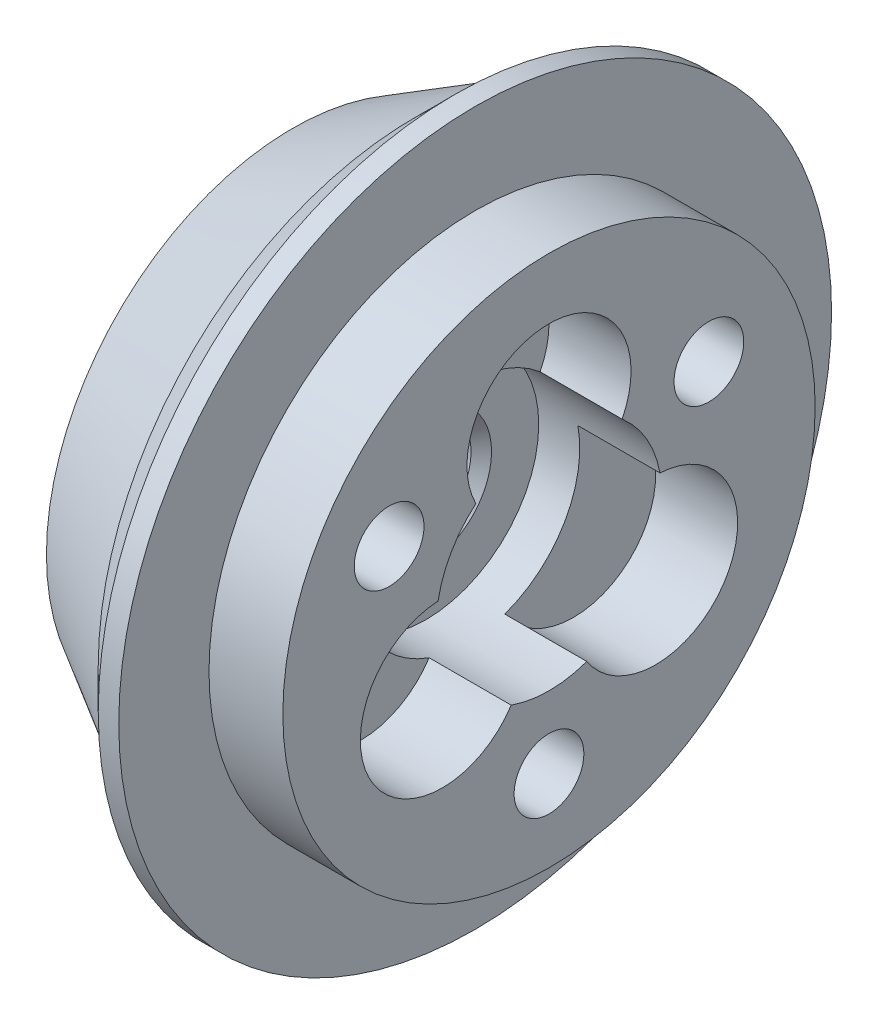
ISO-10303-21;
HEADER;
FILE_DESCRIPTION(('STEP AP214'),'2;1');
FILE_NAME('part.step','',(''),(''),'','','');
FILE_SCHEMA(('AUTOMOTIVE_DESIGN { 1 0 10303 214 1 1 1 1 }'));
ENDSEC;
DATA;
#1=APPLICATION_CONTEXT('core data for automotive mechanical design processes');
#2=APPLICATION_PROTOCOL_DEFINITION('international standard','automotive_design',2000,#1);
#3=PRODUCT_CONTEXT('',#1,'mechanical');
#4=PRODUCT('Part','Part','',(#3));
#5=PRODUCT_RELATED_PRODUCT_CATEGORY('part','',(#4));
#6=PRODUCT_DEFINITION_FORMATION('','',#4);
#7=PRODUCT_DEFINITION_CONTEXT('part definition',#1,'design');
#8=PRODUCT_DEFINITION('design','',#6,#7);
#9=PRODUCT_DEFINITION_SHAPE('','',#8);
#10=(LENGTH_UNIT() NAMED_UNIT(*) SI_UNIT(.MILLI.,.METRE.));
#11=(NAMED_UNIT(*) PLANE_ANGLE_UNIT() SI_UNIT($,.RADIAN.));
#12=(NAMED_UNIT(*) SI_UNIT($,.STERADIAN.) SOLID_ANGLE_UNIT());
#13=UNCERTAINTY_MEASURE_WITH_UNIT(LENGTH_MEASURE(1.E-05),#10,'distance_accuracy_value','');
#14=(GEOMETRIC_REPRESENTATION_CONTEXT(3) GLOBAL_UNCERTAINTY_ASSIGNED_CONTEXT((#13)) GLOBAL_UNIT_ASSIGNED_CONTEXT((#10,
#11,#12)) REPRESENTATION_CONTEXT('',''));
#15=CARTESIAN_POINT('',(0.,0.,0.));
#16=DIRECTION('',(0.,0.,1.));
#17=DIRECTION('',(1.,0.,0.));
#18=AXIS2_PLACEMENT_3D('',#15,#16,#17);
#19=CARTESIAN_POINT('',(6.,2.01,0.));
#20=DIRECTION('',(1.,0.,0.));
#21=DIRECTION('',(0.,0.,-1.));
#22=AXIS2_PLACEMENT_3D('',#19,#20,#21);
#23=PLANE('',#22);
#24=CARTESIAN_POINT('',(6.,0.,0.));
#25=DIRECTION('',(1.,0.,0.));
#26=DIRECTION('',(0.,0.,-1.));
#27=AXIS2_PLACEMENT_3D('',#24,#25,#26);
#28=CIRCLE('',#27,2.20999999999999);
#29=CARTESIAN_POINT('',(6.,0.,-2.20999999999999));
#30=VERTEX_POINT('',#29);
#31=EDGE_CURVE('E307',#30,#30,#28,.F.);
#32=ORIENTED_EDGE('',*,*,#31,.T.);
#33=EDGE_LOOP('',(#32));
#34=FACE_BOUND('',#33,.T.);
#35=CARTESIAN_POINT('',(6.,0.,0.));
#36=DIRECTION('',(1.,0.,0.));
#37=DIRECTION('',(0.,0.,-1.));
#38=AXIS2_PLACEMENT_3D('',#35,#36,#37);
#39=CIRCLE('',#38,4.5);
#40=CARTESIAN_POINT('',(6.,3.28178047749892,3.07894736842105));
#41=VERTEX_POINT('',#40);
#42=CARTESIAN_POINT('',(6.,-3.28178047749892,3.07894736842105));
#43=VERTEX_POINT('',#42);
#44=EDGE_CURVE('E13',#41,#43,#39,.T.);
#45=ORIENTED_EDGE('',*,*,#44,.T.);
#46=CARTESIAN_POINT('',(6.,-6.92820323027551,6.5));
#47=DIRECTION('',(1.,0.,0.));
#48=DIRECTION('',(0.,0.,-1.));
#49=AXIS2_PLACEMENT_3D('',#46,#47,#48);
#50=CIRCLE('',#49,5.);
#51=CARTESIAN_POINT('',(6.,-5.07028920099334,1.85800091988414));
#52=VERTEX_POINT('',#51);
#53=EDGE_CURVE('E229',#43,#52,#50,.F.);
#54=ORIENTED_EDGE('',*,*,#53,.T.);
#55=CARTESIAN_POINT('',(6.,0.,0.));
#56=DIRECTION('',(-1.,0.,0.));
#57=DIRECTION('',(0.,0.,1.));
#58=AXIS2_PLACEMENT_3D('',#55,#56,#57);
#59=CIRCLE('',#58,5.4);
#60=CARTESIAN_POINT('',(6.,-5.07028920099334,-1.85800091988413));
#61=VERTEX_POINT('',#60);
#62=EDGE_CURVE('E286',#61,#52,#59,.T.);
#63=ORIENTED_EDGE('',*,*,#62,.F.);
#64=CARTESIAN_POINT('',(6.,-6.92820323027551,-6.5));
#65=DIRECTION('',(1.,0.,0.));
#66=DIRECTION('',(0.,0.,-1.));
#67=AXIS2_PLACEMENT_3D('',#64,#65,#66);
#68=CIRCLE('',#67,5.);
#69=CARTESIAN_POINT('',(6.,-3.28178047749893,-3.07894736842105));
#70=VERTEX_POINT('',#69);
#71=EDGE_CURVE('E253',#61,#70,#68,.F.);
#72=ORIENTED_EDGE('',*,*,#71,.T.);
#73=CARTESIAN_POINT('',(6.,0.,0.));
#74=DIRECTION('',(1.,0.,0.));
#75=DIRECTION('',(0.,0.,-1.));
#76=AXIS2_PLACEMENT_3D('',#73,#74,#75);
#77=CIRCLE('',#76,4.5);
#78=CARTESIAN_POINT('',(6.,3.28178047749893,-3.07894736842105));
#79=VERTEX_POINT('',#78);
#80=EDGE_CURVE('E358',#70,#79,#77,.T.);
#81=ORIENTED_EDGE('',*,*,#80,.T.);
#82=CARTESIAN_POINT('',(6.,6.92820323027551,-6.5));
#83=DIRECTION('',(1.,0.,0.));
#84=DIRECTION('',(0.,0.,-1.));
#85=AXIS2_PLACEMENT_3D('',#82,#83,#84);
#86=CIRCLE('',#85,5.);
#87=CARTESIAN_POINT('',(6.,5.07028920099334,-1.85800091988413));
#88=VERTEX_POINT('',#87);
#89=EDGE_CURVE('E262',#88,#79,#86,.T.);
#90=ORIENTED_EDGE('',*,*,#89,.F.);
#91=CARTESIAN_POINT('',(6.,5.07028920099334,1.85800091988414));
#92=VERTEX_POINT('',#91);
#93=EDGE_CURVE('E285',#92,#88,#59,.T.);
#94=ORIENTED_EDGE('',*,*,#93,.F.);
#95=CARTESIAN_POINT('',(6.,6.92820323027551,6.5));
#96=DIRECTION('',(1.,0.,0.));
#97=DIRECTION('',(0.,0.,-1.));
#98=AXIS2_PLACEMENT_3D('',#95,#96,#97);
#99=CIRCLE('',#98,5.);
#100=EDGE_CURVE('E222',#41,#92,#99,.T.);
#101=ORIENTED_EDGE('',*,*,#100,.F.);
#102=EDGE_LOOP('',(#45,#54,#63,#72,#81,#90,#94,#101));
#103=FACE_BOUND('',#102,.T.);
#104=ADVANCED_FACE('F44',(#34,#103),#23,.T.);
#105=CARTESIAN_POINT('',(0.,0.,0.));
#106=DIRECTION('',(-1.,0.,0.));
#107=DIRECTION('',(0.,0.,1.));
#108=AXIS2_PLACEMENT_3D('',#105,#106,#107);
#109=CYLINDRICAL_SURFACE('',#108,5.4);
#110=CARTESIAN_POINT('',(12.,0.,0.));
#111=DIRECTION('',(1.,0.,0.));
#112=DIRECTION('',(0.,0.,-1.));
#113=AXIS2_PLACEMENT_3D('',#110,#111,#112);
#114=CIRCLE('',#113,5.4);
#115=CARTESIAN_POINT('',(12.,0.,-5.4));
#116=VERTEX_POINT('',#115);
#117=EDGE_CURVE('E322',#116,#116,#114,.T.);
#118=ORIENTED_EDGE('',*,*,#117,.T.);
#119=EDGE_LOOP('',(#118));
#120=FACE_BOUND('',#119,.T.);
#121=ORIENTED_EDGE('',*,*,#62,.T.);
#122=DIRECTION('',(-1.,0.,0.));
#123=VECTOR('',#122,1.);
#124=CARTESIAN_POINT('',(8.,-5.07028920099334,1.85800091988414));
#125=LINE('',#124,#123);
#126=CARTESIAN_POINT('',(10.,-5.07028920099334,1.85800091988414));
#127=VERTEX_POINT('',#126);
#128=EDGE_CURVE('E52',#52,#127,#125,.F.);
#129=ORIENTED_EDGE('',*,*,#128,.T.);
#130=CARTESIAN_POINT('',(10.,0.,0.));
#131=DIRECTION('',(-1.,0.,0.));
#132=DIRECTION('',(0.,0.,1.));
#133=AXIS2_PLACEMENT_3D('',#130,#131,#132);
#134=CIRCLE('',#133,5.4);
#135=CARTESIAN_POINT('',(10.,5.07028920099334,1.85800091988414));
#136=VERTEX_POINT('',#135);
#137=EDGE_CURVE('E361',#127,#136,#134,.T.);
#138=ORIENTED_EDGE('',*,*,#137,.T.);
#139=DIRECTION('',(-1.,0.,0.));
#140=VECTOR('',#139,1.);
#141=CARTESIAN_POINT('',(8.,5.07028920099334,1.85800091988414));
#142=LINE('',#141,#140);
#143=EDGE_CURVE('E364',#92,#136,#142,.F.);
#144=ORIENTED_EDGE('',*,*,#143,.F.);
#145=ORIENTED_EDGE('',*,*,#93,.T.);
#146=DIRECTION('',(-1.,0.,0.));
#147=VECTOR('',#146,1.);
#148=CARTESIAN_POINT('',(5.,5.07028920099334,-1.85800091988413));
#149=LINE('',#148,#147);
#150=CARTESIAN_POINT('',(10.,5.07028920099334,-1.85800091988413));
#151=VERTEX_POINT('',#150);
#152=EDGE_CURVE('E355',#151,#88,#149,.T.);
#153=ORIENTED_EDGE('',*,*,#152,.F.);
#154=CARTESIAN_POINT('',(10.,0.,0.));
#155=DIRECTION('',(-1.,0.,0.));
#156=DIRECTION('',(0.,0.,1.));
#157=AXIS2_PLACEMENT_3D('',#154,#155,#156);
#158=CIRCLE('',#157,5.4);
#159=CARTESIAN_POINT('',(10.,-5.07028920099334,-1.85800091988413));
#160=VERTEX_POINT('',#159);
#161=EDGE_CURVE('E349',#151,#160,#158,.T.);
#162=ORIENTED_EDGE('',*,*,#161,.T.);
#163=DIRECTION('',(-1.,0.,0.));
#164=VECTOR('',#163,1.);
#165=CARTESIAN_POINT('',(8.,-5.07028920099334,-1.85800091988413));
#166=LINE('',#165,#164);
#167=EDGE_CURVE('E352',#160,#61,#166,.T.);
#168=ORIENTED_EDGE('',*,*,#167,.T.);
#169=EDGE_LOOP('',(#121,#129,#138,#144,#145,#153,#162,#168));
#170=FACE_BOUND('',#169,.T.);
#171=ADVANCED_FACE('F367',(#120,#170),#109,.F.);
#172=CARTESIAN_POINT('',(0.,0.,0.));
#173=DIRECTION('',(1.,0.,0.));
#174=DIRECTION('',(0.,0.,-1.));
#175=AXIS2_PLACEMENT_3D('',#172,#173,#174);
#176=PLANE('',#175);
#177=CARTESIAN_POINT('',(0.,6.92820323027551,6.5));
#178=DIRECTION('',(-1.,0.,0.));
#179=DIRECTION('',(0.,0.,1.));
#180=AXIS2_PLACEMENT_3D('',#177,#178,#179);
#181=CIRCLE('',#180,5.);
#182=CARTESIAN_POINT('',(0.,10.5746259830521,9.92105263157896));
#183=VERTEX_POINT('',#182);
#184=CARTESIAN_POINT('',(0.,3.28178047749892,3.07894736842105));
#185=VERTEX_POINT('',#184);
#186=EDGE_CURVE('E212',#183,#185,#181,.T.);
#187=ORIENTED_EDGE('',*,*,#186,.F.);
#188=CARTESIAN_POINT('',(0.,0.,0.));
#189=DIRECTION('',(-1.,0.,0.));
#190=DIRECTION('',(0.,0.,1.));
#191=AXIS2_PLACEMENT_3D('',#188,#189,#190);
#192=CIRCLE('',#191,14.5);
#193=CARTESIAN_POINT('',(0.,-10.5746259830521,9.92105263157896));
#194=VERTEX_POINT('',#193);
#195=EDGE_CURVE('E59',#194,#183,#192,.T.);
#196=ORIENTED_EDGE('',*,*,#195,.F.);
#197=CARTESIAN_POINT('',(0.,-6.92820323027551,6.5));
#198=DIRECTION('',(-1.,0.,0.));
#199=DIRECTION('',(0.,0.,1.));
#200=AXIS2_PLACEMENT_3D('',#197,#198,#199);
#201=CIRCLE('',#200,5.);
#202=CARTESIAN_POINT('',(0.,-3.28178047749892,3.07894736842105));
#203=VERTEX_POINT('',#202);
#204=EDGE_CURVE('E205',#194,#203,#201,.F.);
#205=ORIENTED_EDGE('',*,*,#204,.T.);
#206=CARTESIAN_POINT('',(0.,0.,0.));
#207=DIRECTION('',(-1.,0.,0.));
#208=DIRECTION('',(0.,0.,1.));
#209=AXIS2_PLACEMENT_3D('',#206,#207,#208);
#210=CIRCLE('',#209,4.5);
#211=EDGE_CURVE('E215',#203,#185,#210,.T.);
#212=ORIENTED_EDGE('',*,*,#211,.T.);
#213=EDGE_LOOP('',(#187,#196,#205,#212));
#214=FACE_BOUND('',#213,.T.);
#215=CARTESIAN_POINT('',(0.,0.,0.));
#216=DIRECTION('',(-1.,0.,0.));
#217=DIRECTION('',(0.,0.,1.));
#218=AXIS2_PLACEMENT_3D('',#215,#216,#217);
#219=CIRCLE('',#218,14.5);
#220=CARTESIAN_POINT('',(0.,10.5746259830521,-9.92105263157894));
#221=VERTEX_POINT('',#220);
#222=CARTESIAN_POINT('',(0.,-10.5746259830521,-9.92105263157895));
#223=VERTEX_POINT('',#222);
#224=EDGE_CURVE('E243',#221,#223,#219,.T.);
#225=ORIENTED_EDGE('',*,*,#224,.F.);
#226=CARTESIAN_POINT('',(0.,6.92820323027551,-6.5));
#227=DIRECTION('',(-1.,0.,0.));
#228=DIRECTION('',(0.,0.,1.));
#229=AXIS2_PLACEMENT_3D('',#226,#227,#228);
#230=CIRCLE('',#229,5.);
#231=CARTESIAN_POINT('',(0.,3.28178047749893,-3.07894736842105));
#232=VERTEX_POINT('',#231);
#233=EDGE_CURVE('E232',#232,#221,#230,.T.);
#234=ORIENTED_EDGE('',*,*,#233,.F.);
#235=CARTESIAN_POINT('',(0.,0.,0.));
#236=DIRECTION('',(-1.,0.,0.));
#237=DIRECTION('',(0.,0.,1.));
#238=AXIS2_PLACEMENT_3D('',#235,#236,#237);
#239=CIRCLE('',#238,4.5);
#240=CARTESIAN_POINT('',(0.,-3.28178047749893,-3.07894736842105));
#241=VERTEX_POINT('',#240);
#242=EDGE_CURVE('E236',#232,#241,#239,.T.);
#243=ORIENTED_EDGE('',*,*,#242,.T.);
#244=CARTESIAN_POINT('',(0.,-6.92820323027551,-6.5));
#245=DIRECTION('',(-1.,0.,0.));
#246=DIRECTION('',(0.,0.,1.));
#247=AXIS2_PLACEMENT_3D('',#244,#245,#246);
#248=CIRCLE('',#247,5.);
#249=EDGE_CURVE('E246',#241,#223,#248,.F.);
#250=ORIENTED_EDGE('',*,*,#249,.T.);
#251=EDGE_LOOP('',(#225,#234,#243,#250));
#252=FACE_BOUND('',#251,.T.);
#253=CARTESIAN_POINT('',(0.,0.,0.));
#254=DIRECTION('',(1.,0.,0.));
#255=DIRECTION('',(0.,0.,-1.));
#256=AXIS2_PLACEMENT_3D('',#253,#254,#255);
#257=CIRCLE('',#256,2.21000000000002);
#258=CARTESIAN_POINT('',(0.,0.,-2.21000000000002));
#259=VERTEX_POINT('',#258);
#260=EDGE_CURVE('E316',#259,#259,#257,.T.);
#261=ORIENTED_EDGE('',*,*,#260,.T.);
#262=EDGE_LOOP('',(#261));
#263=FACE_BOUND('',#262,.T.);
#264=CARTESIAN_POINT('',(0.,0.,0.));
#265=DIRECTION('',(-1.,0.,0.));
#266=DIRECTION('',(0.,0.,1.));
#267=AXIS2_PLACEMENT_3D('',#264,#265,#266);
#268=CIRCLE('',#267,24.);
#269=CARTESIAN_POINT('',(0.,0.,24.));
#270=VERTEX_POINT('',#269);
#271=EDGE_CURVE('E304',#270,#270,#268,.T.);
#272=ORIENTED_EDGE('',*,*,#271,.T.);
#273=EDGE_LOOP('',(#272));
#274=FACE_BOUND('',#273,.T.);
#275=ADVANCED_FACE('F385',(#214,#252,#263,#274),#176,.F.);
#276=CARTESIAN_POINT('',(25.,25.95,0.));
#277=DIRECTION('',(-1.,0.,0.));
#278=DIRECTION('',(0.,0.,1.));
#279=AXIS2_PLACEMENT_3D('',#276,#277,#278);
#280=PLANE('',#279);
#281=CARTESIAN_POINT('',(25.,9.00000000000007,15.5884572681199));
#282=DIRECTION('',(1.,0.,0.));
#283=DIRECTION('',(0.,0.,-1.));
#284=AXIS2_PLACEMENT_3D('',#281,#282,#283);
#285=CIRCLE('',#284,3.4);
#286=CARTESIAN_POINT('',(25.,9.00000000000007,12.1884572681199));
#287=VERTEX_POINT('',#286);
#288=EDGE_CURVE('E186',#287,#287,#285,.T.);
#289=ORIENTED_EDGE('',*,*,#288,.F.);
#290=EDGE_LOOP('',(#289));
#291=FACE_BOUND('',#290,.T.);
#292=CARTESIAN_POINT('',(25.,8.99999999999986,-15.58845726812));
#293=DIRECTION('',(1.,0.,0.));
#294=DIRECTION('',(0.,0.,-1.));
#295=AXIS2_PLACEMENT_3D('',#292,#293,#294);
#296=CIRCLE('',#295,3.4);
#297=CARTESIAN_POINT('',(25.,8.99999999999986,-18.98845726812));
#298=VERTEX_POINT('',#297);
#299=EDGE_CURVE('E194',#298,#298,#296,.T.);
#300=ORIENTED_EDGE('',*,*,#299,.F.);
#301=EDGE_LOOP('',(#300));
#302=FACE_BOUND('',#301,.T.);
#303=CARTESIAN_POINT('',(25.,-18.,0.));
#304=DIRECTION('',(1.,0.,0.));
#305=DIRECTION('',(0.,0.,-1.));
#306=AXIS2_PLACEMENT_3D('',#303,#304,#305);
#307=CIRCLE('',#306,3.4);
#308=CARTESIAN_POINT('',(25.,-18.,-3.4));
#309=VERTEX_POINT('',#308);
#310=EDGE_CURVE('E200',#309,#309,#307,.T.);
#311=ORIENTED_EDGE('',*,*,#310,.F.);
#312=EDGE_LOOP('',(#311));
#313=FACE_BOUND('',#312,.T.);
#314=CARTESIAN_POINT('',(25.,0.,0.));
#315=DIRECTION('',(-1.,0.,0.));
#316=DIRECTION('',(0.,0.,1.));
#317=AXIS2_PLACEMENT_3D('',#314,#315,#316);
#318=CIRCLE('',#317,25.95);
#319=CARTESIAN_POINT('',(25.,0.,25.95));
#320=VERTEX_POINT('',#319);
#321=EDGE_CURVE('E289',#320,#320,#318,.T.);
#322=ORIENTED_EDGE('',*,*,#321,.F.);
#323=EDGE_LOOP('',(#322));
#324=FACE_BOUND('',#323,.T.);
#325=CARTESIAN_POINT('',(25.,0.,0.));
#326=DIRECTION('',(-1.,0.,0.));
#327=DIRECTION('',(0.,0.,1.));
#328=AXIS2_PLACEMENT_3D('',#325,#326,#327);
#329=CIRCLE('',#328,11.);
#330=CARTESIAN_POINT('',(25.,-10.3636259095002,-3.68717480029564));
#331=VERTEX_POINT('',#330);
#332=CARTESIAN_POINT('',(25.,-10.3636259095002,3.68717480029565));
#333=VERTEX_POINT('',#332);
#334=EDGE_CURVE('E282',#331,#333,#329,.T.);
#335=ORIENTED_EDGE('',*,*,#334,.T.);
#336=CARTESIAN_POINT('',(25.,-6.00000000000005,10.3923048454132));
#337=DIRECTION('',(1.,0.,0.));
#338=DIRECTION('',(0.,0.,-1.));
#339=AXIS2_PLACEMENT_3D('',#336,#337,#338);
#340=CIRCLE('',#339,8.);
#341=CARTESIAN_POINT('',(25.,1.98862590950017,10.8187507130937));
#342=VERTEX_POINT('',#341);
#343=EDGE_CURVE('E264',#342,#333,#340,.T.);
#344=ORIENTED_EDGE('',*,*,#343,.F.);
#345=CARTESIAN_POINT('',(25.,8.375,7.13157591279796));
#346=VERTEX_POINT('',#345);
#347=EDGE_CURVE('E275',#342,#346,#329,.T.);
#348=ORIENTED_EDGE('',*,*,#347,.T.);
#349=CARTESIAN_POINT('',(25.,12.,0.));
#350=DIRECTION('',(1.,0.,0.));
#351=DIRECTION('',(0.,0.,-1.));
#352=AXIS2_PLACEMENT_3D('',#349,#350,#351);
#353=CIRCLE('',#352,8.);
#354=CARTESIAN_POINT('',(25.,8.375,-7.13157591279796));
#355=VERTEX_POINT('',#354);
#356=EDGE_CURVE('E271',#355,#346,#353,.T.);
#357=ORIENTED_EDGE('',*,*,#356,.F.);
#358=CARTESIAN_POINT('',(25.,1.98862590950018,-10.8187507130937));
#359=VERTEX_POINT('',#358);
#360=EDGE_CURVE('E278',#355,#359,#329,.T.);
#361=ORIENTED_EDGE('',*,*,#360,.T.);
#362=CARTESIAN_POINT('',(25.,-6.00000000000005,-10.3923048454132));
#363=DIRECTION('',(1.,0.,0.));
#364=DIRECTION('',(0.,0.,-1.));
#365=AXIS2_PLACEMENT_3D('',#362,#363,#364);
#366=CIRCLE('',#365,8.00000000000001);
#367=EDGE_CURVE('E267',#331,#359,#366,.T.);
#368=ORIENTED_EDGE('',*,*,#367,.F.);
#369=EDGE_LOOP('',(#335,#344,#348,#357,#361,#368));
#370=FACE_BOUND('',#369,.T.);
#371=ADVANCED_FACE('F439',(#291,#302,#313,#324,#370),#280,.F.);
#372=CARTESIAN_POINT('',(11.95,0.,0.));
#373=DIRECTION('',(1.,0.,0.));
#374=DIRECTION('',(0.,0.,-1.));
#375=AXIS2_PLACEMENT_3D('',#372,#373,#374);
#376=CONICAL_SURFACE('',#375,30.9,0.523640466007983);
#377=ORIENTED_EDGE('',*,*,#271,.F.);
#378=EDGE_LOOP('',(#377));
#379=FACE_BOUND('',#378,.T.);
#380=CARTESIAN_POINT('',(11.95,0.,0.));
#381=DIRECTION('',(-1.,0.,0.));
#382=DIRECTION('',(0.,0.,1.));
#383=AXIS2_PLACEMENT_3D('',#380,#381,#382);
#384=CIRCLE('',#383,30.9);
#385=CARTESIAN_POINT('',(11.95,0.,30.9));
#386=VERTEX_POINT('',#385);
#387=EDGE_CURVE('E301',#386,#386,#384,.T.);
#388=ORIENTED_EDGE('',*,*,#387,.T.);
#389=EDGE_LOOP('',(#388));
#390=FACE_BOUND('',#389,.T.);
#391=ADVANCED_FACE('F442',(#379,#390),#376,.T.);
#392=CARTESIAN_POINT('',(15.8,0.,0.));
#393=DIRECTION('',(1.,0.,0.));
#394=DIRECTION('',(0.,0.,-1.));
#395=AXIS2_PLACEMENT_3D('',#392,#393,#394);
#396=CONICAL_SURFACE('',#395,34.75,0.785398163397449);
#397=ORIENTED_EDGE('',*,*,#387,.F.);
#398=EDGE_LOOP('',(#397));
#399=FACE_BOUND('',#398,.T.);
#400=CARTESIAN_POINT('',(15.8,0.,0.));
#401=DIRECTION('',(-1.,0.,0.));
#402=DIRECTION('',(0.,0.,1.));
#403=AXIS2_PLACEMENT_3D('',#400,#401,#402);
#404=CIRCLE('',#403,34.75);
#405=CARTESIAN_POINT('',(15.8,0.,34.75));
#406=VERTEX_POINT('',#405);
#407=EDGE_CURVE('E298',#406,#406,#404,.T.);
#408=ORIENTED_EDGE('',*,*,#407,.T.);
#409=EDGE_LOOP('',(#408));
#410=FACE_BOUND('',#409,.T.);
#411=ADVANCED_FACE('F454',(#399,#410),#396,.T.);
#412=CARTESIAN_POINT('',(0.,0.,0.));
#413=DIRECTION('',(-1.,0.,0.));
#414=DIRECTION('',(0.,0.,1.));
#415=AXIS2_PLACEMENT_3D('',#412,#413,#414);
#416=CYLINDRICAL_SURFACE('',#415,34.75);
#417=ORIENTED_EDGE('',*,*,#407,.F.);
#418=EDGE_LOOP('',(#417));
#419=FACE_BOUND('',#418,.T.);
#420=CARTESIAN_POINT('',(17.8,0.,0.));
#421=DIRECTION('',(-1.,0.,0.));
#422=DIRECTION('',(0.,0.,1.));
#423=AXIS2_PLACEMENT_3D('',#420,#421,#422);
#424=CIRCLE('',#423,34.75);
#425=CARTESIAN_POINT('',(17.8,0.,34.75));
#426=VERTEX_POINT('',#425);
#427=EDGE_CURVE('E295',#426,#426,#424,.T.);
#428=ORIENTED_EDGE('',*,*,#427,.T.);
#429=EDGE_LOOP('',(#428));
#430=FACE_BOUND('',#429,.T.);
#431=ADVANCED_FACE('F450',(#419,#430),#416,.T.);
#432=CARTESIAN_POINT('',(17.8,34.75,0.));
#433=DIRECTION('',(-1.,0.,0.));
#434=DIRECTION('',(0.,0.,1.));
#435=AXIS2_PLACEMENT_3D('',#432,#433,#434);
#436=PLANE('',#435);
#437=ORIENTED_EDGE('',*,*,#427,.F.);
#438=EDGE_LOOP('',(#437));
#439=FACE_BOUND('',#438,.T.);
#440=CARTESIAN_POINT('',(17.8,0.,0.));
#441=DIRECTION('',(-1.,0.,0.));
#442=DIRECTION('',(0.,0.,1.));
#443=AXIS2_PLACEMENT_3D('',#440,#441,#442);
#444=CIRCLE('',#443,25.95);
#445=CARTESIAN_POINT('',(17.8,0.,25.95));
#446=VERTEX_POINT('',#445);
#447=EDGE_CURVE('E292',#446,#446,#444,.T.);
#448=ORIENTED_EDGE('',*,*,#447,.T.);
#449=EDGE_LOOP('',(#448));
#450=FACE_BOUND('',#449,.T.);
#451=ADVANCED_FACE('F446',(#439,#450),#436,.F.);
#452=CARTESIAN_POINT('',(0.,0.,0.));
#453=DIRECTION('',(-1.,0.,0.));
#454=DIRECTION('',(0.,0.,1.));
#455=AXIS2_PLACEMENT_3D('',#452,#453,#454);
#456=CYLINDRICAL_SURFACE('',#455,25.95);
#457=ORIENTED_EDGE('',*,*,#447,.F.);
#458=EDGE_LOOP('',(#457));
#459=FACE_BOUND('',#458,.T.);
#460=ORIENTED_EDGE('',*,*,#321,.T.);
#461=EDGE_LOOP('',(#460));
#462=FACE_BOUND('',#461,.T.);
#463=ADVANCED_FACE('F437',(#459,#462),#456,.T.);
#464=CARTESIAN_POINT('',(0.,0.,0.));
#465=DIRECTION('',(-1.,0.,0.));
#466=DIRECTION('',(0.,0.,1.));
#467=AXIS2_PLACEMENT_3D('',#464,#465,#466);
#468=CYLINDRICAL_SURFACE('',#467,2.01);
#469=CARTESIAN_POINT('',(5.80000000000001,0.,0.));
#470=DIRECTION('',(1.,0.,0.));
#471=DIRECTION('',(0.,0.,-1.));
#472=AXIS2_PLACEMENT_3D('',#469,#470,#471);
#473=CIRCLE('',#472,2.01);
#474=CARTESIAN_POINT('',(5.80000000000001,0.,-2.01));
#475=VERTEX_POINT('',#474);
#476=EDGE_CURVE('E313',#475,#475,#473,.T.);
#477=ORIENTED_EDGE('',*,*,#476,.T.);
#478=EDGE_LOOP('',(#477));
#479=FACE_BOUND('',#478,.T.);
#480=CARTESIAN_POINT('',(0.200000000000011,0.,0.));
#481=DIRECTION('',(1.,0.,0.));
#482=DIRECTION('',(0.,0.,-1.));
#483=AXIS2_PLACEMENT_3D('',#480,#481,#482);
#484=CIRCLE('',#483,2.01);
#485=CARTESIAN_POINT('',(0.200000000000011,0.,-2.01));
#486=VERTEX_POINT('',#485);
#487=EDGE_CURVE('E310',#486,#486,#484,.F.);
#488=ORIENTED_EDGE('',*,*,#487,.T.);
#489=EDGE_LOOP('',(#488));
#490=FACE_BOUND('',#489,.T.);
#491=ADVANCED_FACE('F433',(#479,#490),#468,.F.);
#492=CARTESIAN_POINT('',(13.,5.4,0.));
#493=DIRECTION('',(1.,0.,0.));
#494=DIRECTION('',(0.,0.,-1.));
#495=AXIS2_PLACEMENT_3D('',#492,#493,#494);
#496=PLANE('',#495);
#497=CARTESIAN_POINT('',(13.,0.,0.));
#498=DIRECTION('',(1.,0.,0.));
#499=DIRECTION('',(0.,0.,-1.));
#500=AXIS2_PLACEMENT_3D('',#497,#498,#499);
#501=CIRCLE('',#500,6.39999999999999);
#502=CARTESIAN_POINT('',(13.,0.,-6.39999999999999));
#503=VERTEX_POINT('',#502);
#504=EDGE_CURVE('E319',#503,#503,#501,.F.);
#505=ORIENTED_EDGE('',*,*,#504,.T.);
#506=EDGE_LOOP('',(#505));
#507=FACE_BOUND('',#506,.T.);
#508=CARTESIAN_POINT('',(13.,0.,0.));
#509=DIRECTION('',(-1.,0.,0.));
#510=DIRECTION('',(0.,0.,1.));
#511=AXIS2_PLACEMENT_3D('',#508,#509,#510);
#512=CIRCLE('',#511,11.);
#513=CARTESIAN_POINT('',(13.,0.,11.));
#514=VERTEX_POINT('',#513);
#515=EDGE_CURVE('E281',#514,#514,#512,.T.);
#516=ORIENTED_EDGE('',*,*,#515,.F.);
#517=EDGE_LOOP('',(#516));
#518=FACE_BOUND('',#517,.T.);
#519=ADVANCED_FACE('F436',(#507,#518),#496,.T.);
#520=CARTESIAN_POINT('',(0.,0.,0.));
#521=DIRECTION('',(-1.,0.,0.));
#522=DIRECTION('',(0.,0.,1.));
#523=AXIS2_PLACEMENT_3D('',#520,#521,#522);
#524=CYLINDRICAL_SURFACE('',#523,11.);
#525=DIRECTION('',(1.,0.,0.));
#526=VECTOR('',#525,1.);
#527=CARTESIAN_POINT('',(21.,1.98862590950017,10.8187507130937));
#528=LINE('',#527,#526);
#529=CARTESIAN_POINT('',(17.,1.98862590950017,10.8187507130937));
#530=VERTEX_POINT('',#529);
#531=EDGE_CURVE('E347',#530,#342,#528,.T.);
#532=ORIENTED_EDGE('',*,*,#531,.F.);
#533=CARTESIAN_POINT('',(17.,0.,0.));
#534=DIRECTION('',(1.,0.,0.));
#535=DIRECTION('',(0.,0.,-1.));
#536=AXIS2_PLACEMENT_3D('',#533,#534,#535);
#537=CIRCLE('',#536,11.);
#538=CARTESIAN_POINT('',(17.,-10.3636259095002,3.68717480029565));
#539=VERTEX_POINT('',#538);
#540=EDGE_CURVE('E341',#530,#539,#537,.T.);
#541=ORIENTED_EDGE('',*,*,#540,.T.);
#542=DIRECTION('',(1.,0.,0.));
#543=VECTOR('',#542,1.);
#544=CARTESIAN_POINT('',(21.,-10.3636259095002,3.68717480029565));
#545=LINE('',#544,#543);
#546=EDGE_CURVE('E344',#333,#539,#545,.F.);
#547=ORIENTED_EDGE('',*,*,#546,.F.);
#548=ORIENTED_EDGE('',*,*,#334,.F.);
#549=DIRECTION('',(1.,0.,0.));
#550=VECTOR('',#549,1.);
#551=CARTESIAN_POINT('',(21.,-10.3636259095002,-3.68717480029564));
#552=LINE('',#551,#550);
#553=CARTESIAN_POINT('',(17.,-10.3636259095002,-3.68717480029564));
#554=VERTEX_POINT('',#553);
#555=EDGE_CURVE('E339',#554,#331,#552,.T.);
#556=ORIENTED_EDGE('',*,*,#555,.F.);
#557=CARTESIAN_POINT('',(17.,0.,0.));
#558=DIRECTION('',(1.,0.,0.));
#559=DIRECTION('',(0.,0.,-1.));
#560=AXIS2_PLACEMENT_3D('',#557,#558,#559);
#561=CIRCLE('',#560,11.);
#562=CARTESIAN_POINT('',(17.,1.98862590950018,-10.8187507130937));
#563=VERTEX_POINT('',#562);
#564=EDGE_CURVE('E333',#554,#563,#561,.T.);
#565=ORIENTED_EDGE('',*,*,#564,.T.);
#566=DIRECTION('',(1.,0.,0.));
#567=VECTOR('',#566,1.);
#568=CARTESIAN_POINT('',(21.,1.98862590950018,-10.8187507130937));
#569=LINE('',#568,#567);
#570=EDGE_CURVE('E336',#359,#563,#569,.F.);
#571=ORIENTED_EDGE('',*,*,#570,.F.);
#572=ORIENTED_EDGE('',*,*,#360,.F.);
#573=DIRECTION('',(1.,0.,0.));
#574=VECTOR('',#573,1.);
#575=CARTESIAN_POINT('',(21.,8.375,-7.13157591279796));
#576=LINE('',#575,#574);
#577=CARTESIAN_POINT('',(17.,8.375,-7.13157591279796));
#578=VERTEX_POINT('',#577);
#579=EDGE_CURVE('E331',#578,#355,#576,.T.);
#580=ORIENTED_EDGE('',*,*,#579,.F.);
#581=CARTESIAN_POINT('',(17.,0.,0.));
#582=DIRECTION('',(1.,0.,0.));
#583=DIRECTION('',(0.,0.,-1.));
#584=AXIS2_PLACEMENT_3D('',#581,#582,#583);
#585=CIRCLE('',#584,11.);
#586=CARTESIAN_POINT('',(17.,8.375,7.13157591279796));
#587=VERTEX_POINT('',#586);
#588=EDGE_CURVE('E325',#578,#587,#585,.T.);
#589=ORIENTED_EDGE('',*,*,#588,.T.);
#590=DIRECTION('',(1.,0.,0.));
#591=VECTOR('',#590,1.);
#592=CARTESIAN_POINT('',(21.,8.375,7.13157591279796));
#593=LINE('',#592,#591);
#594=EDGE_CURVE('E328',#346,#587,#593,.F.);
#595=ORIENTED_EDGE('',*,*,#594,.F.);
#596=ORIENTED_EDGE('',*,*,#347,.F.);
#597=EDGE_LOOP('',(#532,#541,#547,#548,#556,#565,#571,#572,#580,#589,#595,#596));
#598=FACE_BOUND('',#597,.T.);
#599=ORIENTED_EDGE('',*,*,#515,.T.);
#600=EDGE_LOOP('',(#599));
#601=FACE_BOUND('',#600,.T.);
#602=ADVANCED_FACE('F467',(#598,#601),#524,.F.);
#603=CARTESIAN_POINT('',(6.,0.,0.));
#604=DIRECTION('',(1.,0.,0.));
#605=DIRECTION('',(0.,0.,-1.));
#606=AXIS2_PLACEMENT_3D('',#603,#604,#605);
#607=CONICAL_SURFACE('',#606,2.20999999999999,0.78539816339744);
#608=CARTESIAN_POINT('',(5.80000000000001,0.,-2.01));
#609=CARTESIAN_POINT('',(5.80208333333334,0.,-2.01208333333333));
#610=CARTESIAN_POINT('',(5.80416666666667,0.,-2.01416666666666));
#611=CARTESIAN_POINT('',(5.80833333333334,0.,-2.01833333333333));
#612=CARTESIAN_POINT('',(5.81041666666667,0.,-2.02041666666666));
#613=CARTESIAN_POINT('',(5.81458333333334,0.,-2.02458333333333));
#614=CARTESIAN_POINT('',(5.81666666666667,0.,-2.02666666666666));
#615=CARTESIAN_POINT('',(5.82083333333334,0.,-2.03083333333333));
#616=CARTESIAN_POINT('',(5.82291666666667,0.,-2.03291666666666));
#617=CARTESIAN_POINT('',(5.82708333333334,0.,-2.03708333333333));
#618=CARTESIAN_POINT('',(5.82916666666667,0.,-2.03916666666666));
#619=CARTESIAN_POINT('',(5.83333333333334,0.,-2.04333333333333));
#620=CARTESIAN_POINT('',(5.83541666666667,0.,-2.04541666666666));
#621=CARTESIAN_POINT('',(5.83958333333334,0.,-2.04958333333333));
#622=CARTESIAN_POINT('',(5.84166666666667,0.,-2.05166666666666));
#623=CARTESIAN_POINT('',(5.84583333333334,0.,-2.05583333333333));
#624=CARTESIAN_POINT('',(5.84791666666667,0.,-2.05791666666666));
#625=CARTESIAN_POINT('',(5.85208333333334,0.,-2.06208333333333));
#626=CARTESIAN_POINT('',(5.85416666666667,0.,-2.06416666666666));
#627=CARTESIAN_POINT('',(5.85833333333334,0.,-2.06833333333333));
#628=CARTESIAN_POINT('',(5.86041666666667,0.,-2.07041666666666));
#629=CARTESIAN_POINT('',(5.86458333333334,0.,-2.07458333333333));
#630=CARTESIAN_POINT('',(5.86666666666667,0.,-2.07666666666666));
#631=CARTESIAN_POINT('',(5.87083333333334,0.,-2.08083333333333));
#632=CARTESIAN_POINT('',(5.87291666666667,0.,-2.08291666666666));
#633=CARTESIAN_POINT('',(5.87708333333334,0.,-2.08708333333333));
#634=CARTESIAN_POINT('',(5.87916666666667,0.,-2.08916666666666));
#635=CARTESIAN_POINT('',(5.88333333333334,0.,-2.09333333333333));
#636=CARTESIAN_POINT('',(5.88541666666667,0.,-2.09541666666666));
#637=CARTESIAN_POINT('',(5.88958333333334,0.,-2.09958333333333));
#638=CARTESIAN_POINT('',(5.89166666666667,0.,-2.10166666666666));
#639=CARTESIAN_POINT('',(5.89583333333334,0.,-2.10583333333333));
#640=CARTESIAN_POINT('',(5.89791666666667,0.,-2.10791666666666));
#641=CARTESIAN_POINT('',(5.90208333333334,0.,-2.11208333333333));
#642=CARTESIAN_POINT('',(5.90416666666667,0.,-2.11416666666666));
#643=CARTESIAN_POINT('',(5.90833333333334,0.,-2.11833333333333));
#644=CARTESIAN_POINT('',(5.91041666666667,0.,-2.12041666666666));
#645=CARTESIAN_POINT('',(5.91458333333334,0.,-2.12458333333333));
#646=CARTESIAN_POINT('',(5.91666666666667,0.,-2.12666666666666));
#647=CARTESIAN_POINT('',(5.92083333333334,0.,-2.13083333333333));
#648=CARTESIAN_POINT('',(5.92291666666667,0.,-2.13291666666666));
#649=CARTESIAN_POINT('',(5.92708333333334,0.,-2.13708333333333));
#650=CARTESIAN_POINT('',(5.92916666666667,0.,-2.13916666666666));
#651=CARTESIAN_POINT('',(5.93333333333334,0.,-2.14333333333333));
#652=CARTESIAN_POINT('',(5.93541666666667,0.,-2.14541666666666));
#653=CARTESIAN_POINT('',(5.93958333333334,0.,-2.14958333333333));
#654=CARTESIAN_POINT('',(5.94166666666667,0.,-2.15166666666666));
#655=CARTESIAN_POINT('',(5.94583333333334,0.,-2.15583333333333));
#656=CARTESIAN_POINT('',(5.94791666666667,0.,-2.15791666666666));
#657=CARTESIAN_POINT('',(5.95208333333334,0.,-2.16208333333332));
#658=CARTESIAN_POINT('',(5.95416666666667,0.,-2.16416666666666));
#659=CARTESIAN_POINT('',(5.95833333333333,0.,-2.16833333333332));
#660=CARTESIAN_POINT('',(5.96041666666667,0.,-2.17041666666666));
#661=CARTESIAN_POINT('',(5.96458333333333,0.,-2.17458333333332));
#662=CARTESIAN_POINT('',(5.96666666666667,0.,-2.17666666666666));
#663=CARTESIAN_POINT('',(5.97083333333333,0.,-2.18083333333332));
#664=CARTESIAN_POINT('',(5.97291666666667,0.,-2.18291666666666));
#665=CARTESIAN_POINT('',(5.97708333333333,0.,-2.18708333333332));
#666=CARTESIAN_POINT('',(5.97916666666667,0.,-2.18916666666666));
#667=CARTESIAN_POINT('',(5.98333333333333,0.,-2.19333333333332));
#668=CARTESIAN_POINT('',(5.98541666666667,0.,-2.19541666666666));
#669=CARTESIAN_POINT('',(5.98958333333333,0.,-2.19958333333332));
#670=CARTESIAN_POINT('',(5.99166666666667,0.,-2.20166666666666));
#671=CARTESIAN_POINT('',(5.99583333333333,0.,-2.20583333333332));
#672=CARTESIAN_POINT('',(5.99791666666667,0.,-2.20791666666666));
#673=CARTESIAN_POINT('',(6.,0.,-2.20999999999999));
#674=B_SPLINE_CURVE_WITH_KNOTS('',3,(#608,#609,#610,#611,#612,#613,#614,#615,#616,#617,#618,
#619,#620,#621,#622,#623,#624,#625,#626,#627,#628,#629,#630,#631,#632,#633,#634,#635,#636,#637,
#638,#639,#640,#641,#642,#643,#644,#645,#646,#647,#648,#649,#650,#651,#652,#653,#654,#655,#656,
#657,#658,#659,#660,#661,#662,#663,#664,#665,#666,#667,#668,#669,#670,#671,#672,#673),
.UNSPECIFIED.,.F.,.F.,(4,2,2,2,2,2,2,2,2,2,2,2,2,2,2,2,2,2,2,2,2,2,2,2,2,2,2,2,2,2,2,2,4),(0.,
0.00883883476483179,0.0176776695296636,0.0265165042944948,0.0353553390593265,0.0441941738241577,
0.0530330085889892,0.0618718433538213,0.0707106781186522,0.079549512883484,0.0883883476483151,
0.0972271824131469,0.106066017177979,0.11490485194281,0.123743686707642,0.132582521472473,
0.141421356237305,0.150260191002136,0.159099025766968,0.167937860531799,0.176776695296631,
0.185615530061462,0.194454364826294,0.203293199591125,0.212132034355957,0.220970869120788,
0.22980970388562,0.238648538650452,0.247487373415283,0.256326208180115,0.265165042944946,
0.274003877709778,0.282842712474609),.UNSPECIFIED.);
#675=EDGE_CURVE('BSEAM464',#475,#30,#674,.T.);
#676=ORIENTED_EDGE('',*,*,#476,.F.);
#677=ORIENTED_EDGE('',*,*,#31,.F.);
#678=ORIENTED_EDGE('',*,*,#675,.T.);
#679=ORIENTED_EDGE('',*,*,#675,.F.);
#680=EDGE_LOOP('',(#676,#678,#677,#679));
#681=FACE_BOUND('',#680,.T.);
#682=ADVANCED_FACE('F464',(#681),#607,.F.);
#683=CARTESIAN_POINT('',(0.200000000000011,0.,0.));
#684=DIRECTION('',(-1.,0.,0.));
#685=DIRECTION('',(0.,0.,1.));
#686=AXIS2_PLACEMENT_3D('',#683,#684,#685);
#687=CONICAL_SURFACE('',#686,2.01,0.785398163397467);
#688=ORIENTED_EDGE('',*,*,#260,.F.);
#689=EDGE_LOOP('',(#688));
#690=FACE_BOUND('',#689,.T.);
#691=ORIENTED_EDGE('',*,*,#487,.F.);
#692=EDGE_LOOP('',(#691));
#693=FACE_BOUND('',#692,.T.);
#694=ADVANCED_FACE('F466',(#690,#693),#687,.F.);
#695=CARTESIAN_POINT('',(13.,0.,0.));
#696=DIRECTION('',(1.,0.,0.));
#697=DIRECTION('',(0.,0.,-1.));
#698=AXIS2_PLACEMENT_3D('',#695,#696,#697);
#699=CONICAL_SURFACE('',#698,6.39999999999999,0.78539816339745);
#700=ORIENTED_EDGE('',*,*,#117,.F.);
#701=EDGE_LOOP('',(#700));
#702=FACE_BOUND('',#701,.T.);
#703=ORIENTED_EDGE('',*,*,#504,.F.);
#704=EDGE_LOOP('',(#703));
#705=FACE_BOUND('',#704,.T.);
#706=ADVANCED_FACE('F46',(#702,#705),#699,.F.);
#707=CARTESIAN_POINT('',(17.,12.,0.));
#708=DIRECTION('',(1.,0.,0.));
#709=DIRECTION('',(0.,0.,-1.));
#710=AXIS2_PLACEMENT_3D('',#707,#708,#709);
#711=CYLINDRICAL_SURFACE('',#710,8.);
#712=ORIENTED_EDGE('',*,*,#579,.T.);
#713=ORIENTED_EDGE('',*,*,#356,.T.);
#714=ORIENTED_EDGE('',*,*,#594,.T.);
#715=CARTESIAN_POINT('',(17.,12.,0.));
#716=DIRECTION('',(1.,0.,0.));
#717=DIRECTION('',(0.,0.,-1.));
#718=AXIS2_PLACEMENT_3D('',#715,#716,#717);
#719=CIRCLE('',#718,8.);
#720=EDGE_CURVE('E273',#578,#587,#719,.T.);
#721=ORIENTED_EDGE('',*,*,#720,.F.);
#722=EDGE_LOOP('',(#712,#713,#714,#721));
#723=FACE_BOUND('',#722,.T.);
#724=ADVANCED_FACE('F474',(#723),#711,.F.);
#725=CARTESIAN_POINT('',(17.,12.,0.));
#726=DIRECTION('',(1.,0.,0.));
#727=DIRECTION('',(0.,0.,-1.));
#728=AXIS2_PLACEMENT_3D('',#725,#726,#727);
#729=PLANE('',#728);
#730=ORIENTED_EDGE('',*,*,#720,.T.);
#731=ORIENTED_EDGE('',*,*,#588,.F.);
#732=EDGE_LOOP('',(#730,#731));
#733=FACE_BOUND('',#732,.T.);
#734=ADVANCED_FACE('F511',(#733),#729,.T.);
#735=CARTESIAN_POINT('',(17.,-6.00000000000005,-10.3923048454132));
#736=DIRECTION('',(1.,0.,0.));
#737=DIRECTION('',(0.,0.,-1.));
#738=AXIS2_PLACEMENT_3D('',#735,#736,#737);
#739=CYLINDRICAL_SURFACE('',#738,8.00000000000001);
#740=ORIENTED_EDGE('',*,*,#555,.T.);
#741=ORIENTED_EDGE('',*,*,#367,.T.);
#742=ORIENTED_EDGE('',*,*,#570,.T.);
#743=CARTESIAN_POINT('',(17.,-6.00000000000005,-10.3923048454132));
#744=DIRECTION('',(1.,0.,0.));
#745=DIRECTION('',(0.,0.,-1.));
#746=AXIS2_PLACEMENT_3D('',#743,#744,#745);
#747=CIRCLE('',#746,8.00000000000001);
#748=EDGE_CURVE('E269',#554,#563,#747,.T.);
#749=ORIENTED_EDGE('',*,*,#748,.F.);
#750=EDGE_LOOP('',(#740,#741,#742,#749));
#751=FACE_BOUND('',#750,.T.);
#752=ADVANCED_FACE('F513',(#751),#739,.F.);
#753=CARTESIAN_POINT('',(17.,-6.00000000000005,-10.3923048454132));
#754=DIRECTION('',(1.,0.,0.));
#755=DIRECTION('',(0.,0.,-1.));
#756=AXIS2_PLACEMENT_3D('',#753,#754,#755);
#757=PLANE('',#756);
#758=ORIENTED_EDGE('',*,*,#748,.T.);
#759=ORIENTED_EDGE('',*,*,#564,.F.);
#760=EDGE_LOOP('',(#758,#759));
#761=FACE_BOUND('',#760,.T.);
#762=ADVANCED_FACE('F519',(#761),#757,.T.);
#763=CARTESIAN_POINT('',(17.,-6.00000000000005,10.3923048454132));
#764=DIRECTION('',(1.,0.,0.));
#765=DIRECTION('',(0.,0.,-1.));
#766=AXIS2_PLACEMENT_3D('',#763,#764,#765);
#767=CYLINDRICAL_SURFACE('',#766,8.);
#768=ORIENTED_EDGE('',*,*,#531,.T.);
#769=ORIENTED_EDGE('',*,*,#343,.T.);
#770=ORIENTED_EDGE('',*,*,#546,.T.);
#771=CARTESIAN_POINT('',(17.,-6.00000000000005,10.3923048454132));
#772=DIRECTION('',(1.,0.,0.));
#773=DIRECTION('',(0.,0.,-1.));
#774=AXIS2_PLACEMENT_3D('',#771,#772,#773);
#775=CIRCLE('',#774,8.);
#776=EDGE_CURVE('E265',#530,#539,#775,.T.);
#777=ORIENTED_EDGE('',*,*,#776,.F.);
#778=EDGE_LOOP('',(#768,#769,#770,#777));
#779=FACE_BOUND('',#778,.T.);
#780=ADVANCED_FACE('F580',(#779),#767,.F.);
#781=CARTESIAN_POINT('',(17.,-6.00000000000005,10.3923048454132));
#782=DIRECTION('',(1.,0.,0.));
#783=DIRECTION('',(0.,0.,-1.));
#784=AXIS2_PLACEMENT_3D('',#781,#782,#783);
#785=PLANE('',#784);
#786=ORIENTED_EDGE('',*,*,#776,.T.);
#787=ORIENTED_EDGE('',*,*,#540,.F.);
#788=EDGE_LOOP('',(#786,#787));
#789=FACE_BOUND('',#788,.T.);
#790=ADVANCED_FACE('F588',(#789),#785,.T.);
#791=CARTESIAN_POINT('',(10.,6.92820323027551,-6.5));
#792=DIRECTION('',(-1.,0.,0.));
#793=DIRECTION('',(0.,0.,1.));
#794=AXIS2_PLACEMENT_3D('',#791,#792,#793);
#795=CYLINDRICAL_SURFACE('',#794,5.);
#796=ORIENTED_EDGE('',*,*,#89,.T.);
#797=DIRECTION('',(-1.,0.,0.));
#798=VECTOR('',#797,1.);
#799=CARTESIAN_POINT('',(10.,3.28178047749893,-3.07894736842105));
#800=LINE('',#799,#798);
#801=EDGE_CURVE('E251',#79,#232,#800,.T.);
#802=ORIENTED_EDGE('',*,*,#801,.T.);
#803=ORIENTED_EDGE('',*,*,#233,.T.);
#804=DIRECTION('',(-1.,0.,0.));
#805=VECTOR('',#804,1.);
#806=CARTESIAN_POINT('',(10.,10.5746259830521,-9.92105263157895));
#807=LINE('',#806,#805);
#808=CARTESIAN_POINT('',(10.,10.5746259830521,-9.92105263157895));
#809=VERTEX_POINT('',#808);
#810=EDGE_CURVE('E241',#809,#221,#807,.T.);
#811=ORIENTED_EDGE('',*,*,#810,.F.);
#812=CARTESIAN_POINT('',(10.,6.92820323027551,-6.5));
#813=DIRECTION('',(-1.,0.,0.));
#814=DIRECTION('',(0.,0.,1.));
#815=AXIS2_PLACEMENT_3D('',#812,#813,#814);
#816=CIRCLE('',#815,5.);
#817=EDGE_CURVE('E233',#151,#809,#816,.T.);
#818=ORIENTED_EDGE('',*,*,#817,.F.);
#819=ORIENTED_EDGE('',*,*,#152,.T.);
#820=EDGE_LOOP('',(#796,#802,#803,#811,#818,#819));
#821=FACE_BOUND('',#820,.T.);
#822=ADVANCED_FACE('F395',(#821),#795,.F.);
#823=CARTESIAN_POINT('',(10.,0.,0.));
#824=DIRECTION('',(-1.,0.,0.));
#825=DIRECTION('',(0.,0.,1.));
#826=AXIS2_PLACEMENT_3D('',#823,#824,#825);
#827=CYLINDRICAL_SURFACE('',#826,4.5);
#828=DIRECTION('',(-1.,0.,0.));
#829=VECTOR('',#828,1.);
#830=CARTESIAN_POINT('',(10.,-3.28178047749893,-3.07894736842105));
#831=LINE('',#830,#829);
#832=EDGE_CURVE('E254',#70,#241,#831,.T.);
#833=ORIENTED_EDGE('',*,*,#832,.T.);
#834=ORIENTED_EDGE('',*,*,#242,.F.);
#835=ORIENTED_EDGE('',*,*,#801,.F.);
#836=ORIENTED_EDGE('',*,*,#80,.F.);
#837=EDGE_LOOP('',(#833,#834,#835,#836));
#838=FACE_BOUND('',#837,.T.);
#839=ADVANCED_FACE('F399',(#838),#827,.T.);
#840=CARTESIAN_POINT('',(10.,-6.92820323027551,-6.5));
#841=DIRECTION('',(-1.,0.,0.));
#842=DIRECTION('',(0.,0.,1.));
#843=AXIS2_PLACEMENT_3D('',#840,#841,#842);
#844=CYLINDRICAL_SURFACE('',#843,5.);
#845=ORIENTED_EDGE('',*,*,#167,.F.);
#846=CARTESIAN_POINT('',(10.,-6.92820323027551,-6.5));
#847=DIRECTION('',(-1.,0.,0.));
#848=DIRECTION('',(0.,0.,1.));
#849=AXIS2_PLACEMENT_3D('',#846,#847,#848);
#850=CIRCLE('',#849,5.);
#851=CARTESIAN_POINT('',(10.,-10.5746259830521,-9.92105263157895));
#852=VERTEX_POINT('',#851);
#853=EDGE_CURVE('E239',#160,#852,#850,.F.);
#854=ORIENTED_EDGE('',*,*,#853,.T.);
#855=DIRECTION('',(-1.,0.,0.));
#856=VECTOR('',#855,1.);
#857=CARTESIAN_POINT('',(10.,-10.5746259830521,-9.92105263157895));
#858=LINE('',#857,#856);
#859=EDGE_CURVE('E256',#852,#223,#858,.T.);
#860=ORIENTED_EDGE('',*,*,#859,.T.);
#861=ORIENTED_EDGE('',*,*,#249,.F.);
#862=ORIENTED_EDGE('',*,*,#832,.F.);
#863=ORIENTED_EDGE('',*,*,#71,.F.);
#864=EDGE_LOOP('',(#845,#854,#860,#861,#862,#863));
#865=FACE_BOUND('',#864,.T.);
#866=ADVANCED_FACE('F414',(#865),#844,.F.);
#867=CARTESIAN_POINT('',(10.,0.,0.));
#868=DIRECTION('',(-1.,0.,0.));
#869=DIRECTION('',(0.,0.,1.));
#870=AXIS2_PLACEMENT_3D('',#867,#868,#869);
#871=CYLINDRICAL_SURFACE('',#870,14.5);
#872=ORIENTED_EDGE('',*,*,#224,.T.);
#873=ORIENTED_EDGE('',*,*,#859,.F.);
#874=CARTESIAN_POINT('',(10.,0.,0.));
#875=DIRECTION('',(-1.,0.,0.));
#876=DIRECTION('',(0.,0.,1.));
#877=AXIS2_PLACEMENT_3D('',#874,#875,#876);
#878=CIRCLE('',#877,14.5);
#879=EDGE_CURVE('E235',#809,#852,#878,.T.);
#880=ORIENTED_EDGE('',*,*,#879,.F.);
#881=ORIENTED_EDGE('',*,*,#810,.T.);
#882=EDGE_LOOP('',(#872,#873,#880,#881));
#883=FACE_BOUND('',#882,.T.);
#884=ADVANCED_FACE('F408',(#883),#871,.F.);
#885=CARTESIAN_POINT('',(10.,-52.9414213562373,0.));
#886=DIRECTION('',(-1.,0.,0.));
#887=DIRECTION('',(0.,0.,1.));
#888=AXIS2_PLACEMENT_3D('',#885,#886,#887);
#889=PLANE('',#888);
#890=ORIENTED_EDGE('',*,*,#817,.T.);
#891=ORIENTED_EDGE('',*,*,#879,.T.);
#892=ORIENTED_EDGE('',*,*,#853,.F.);
#893=ORIENTED_EDGE('',*,*,#161,.F.);
#894=EDGE_LOOP('',(#890,#891,#892,#893));
#895=FACE_BOUND('',#894,.T.);
#896=ADVANCED_FACE('F411',(#895),#889,.T.);
#897=CARTESIAN_POINT('',(10.,0.,0.));
#898=DIRECTION('',(-1.,0.,0.));
#899=DIRECTION('',(0.,0.,1.));
#900=AXIS2_PLACEMENT_3D('',#897,#898,#899);
#901=CYLINDRICAL_SURFACE('',#900,14.5);
#902=ORIENTED_EDGE('',*,*,#195,.T.);
#903=DIRECTION('',(-1.,0.,0.));
#904=VECTOR('',#903,1.);
#905=CARTESIAN_POINT('',(10.,10.5746259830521,9.92105263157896));
#906=LINE('',#905,#904);
#907=CARTESIAN_POINT('',(10.,10.5746259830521,9.92105263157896));
#908=VERTEX_POINT('',#907);
#909=EDGE_CURVE('E210',#908,#183,#906,.T.);
#910=ORIENTED_EDGE('',*,*,#909,.F.);
#911=CARTESIAN_POINT('',(10.,0.,0.));
#912=DIRECTION('',(-1.,0.,0.));
#913=DIRECTION('',(0.,0.,1.));
#914=AXIS2_PLACEMENT_3D('',#911,#912,#913);
#915=CIRCLE('',#914,14.5);
#916=CARTESIAN_POINT('',(10.,-10.5746259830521,9.92105263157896));
#917=VERTEX_POINT('',#916);
#918=EDGE_CURVE('E203',#917,#908,#915,.T.);
#919=ORIENTED_EDGE('',*,*,#918,.F.);
#920=DIRECTION('',(-1.,0.,0.));
#921=VECTOR('',#920,1.);
#922=CARTESIAN_POINT('',(10.,-10.5746259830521,9.92105263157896));
#923=LINE('',#922,#921);
#924=EDGE_CURVE('E220',#917,#194,#923,.T.);
#925=ORIENTED_EDGE('',*,*,#924,.T.);
#926=EDGE_LOOP('',(#902,#910,#919,#925));
#927=FACE_BOUND('',#926,.T.);
#928=ADVANCED_FACE('F390',(#927),#901,.F.);
#929=CARTESIAN_POINT('',(10.,-6.92820323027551,6.5));
#930=DIRECTION('',(-1.,0.,0.));
#931=DIRECTION('',(0.,0.,1.));
#932=AXIS2_PLACEMENT_3D('',#929,#930,#931);
#933=CYLINDRICAL_SURFACE('',#932,5.);
#934=DIRECTION('',(-1.,0.,0.));
#935=VECTOR('',#934,1.);
#936=CARTESIAN_POINT('',(10.,-3.28178047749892,3.07894736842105));
#937=LINE('',#936,#935);
#938=EDGE_CURVE('E223',#43,#203,#937,.T.);
#939=ORIENTED_EDGE('',*,*,#938,.T.);
#940=ORIENTED_EDGE('',*,*,#204,.F.);
#941=ORIENTED_EDGE('',*,*,#924,.F.);
#942=CARTESIAN_POINT('',(10.,-6.92820323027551,6.5));
#943=DIRECTION('',(-1.,0.,0.));
#944=DIRECTION('',(0.,0.,1.));
#945=AXIS2_PLACEMENT_3D('',#942,#943,#944);
#946=CIRCLE('',#945,5.);
#947=EDGE_CURVE('E207',#917,#127,#946,.F.);
#948=ORIENTED_EDGE('',*,*,#947,.T.);
#949=ORIENTED_EDGE('',*,*,#128,.F.);
#950=ORIENTED_EDGE('',*,*,#53,.F.);
#951=EDGE_LOOP('',(#939,#940,#941,#948,#949,#950));
#952=FACE_BOUND('',#951,.T.);
#953=ADVANCED_FACE('F371',(#952),#933,.F.);
#954=CARTESIAN_POINT('',(10.,0.,0.));
#955=DIRECTION('',(-1.,0.,0.));
#956=DIRECTION('',(0.,0.,1.));
#957=AXIS2_PLACEMENT_3D('',#954,#955,#956);
#958=CYLINDRICAL_SURFACE('',#957,4.5);
#959=DIRECTION('',(-1.,0.,0.));
#960=VECTOR('',#959,1.);
#961=CARTESIAN_POINT('',(10.,3.28178047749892,3.07894736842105));
#962=LINE('',#961,#960);
#963=EDGE_CURVE('E225',#41,#185,#962,.T.);
#964=ORIENTED_EDGE('',*,*,#963,.T.);
#965=ORIENTED_EDGE('',*,*,#211,.F.);
#966=ORIENTED_EDGE('',*,*,#938,.F.);
#967=ORIENTED_EDGE('',*,*,#44,.F.);
#968=EDGE_LOOP('',(#964,#965,#966,#967));
#969=FACE_BOUND('',#968,.T.);
#970=ADVANCED_FACE('F379',(#969),#958,.T.);
#971=CARTESIAN_POINT('',(10.,6.92820323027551,6.5));
#972=DIRECTION('',(-1.,0.,0.));
#973=DIRECTION('',(0.,0.,1.));
#974=AXIS2_PLACEMENT_3D('',#971,#972,#973);
#975=CYLINDRICAL_SURFACE('',#974,5.);
#976=ORIENTED_EDGE('',*,*,#100,.T.);
#977=ORIENTED_EDGE('',*,*,#143,.T.);
#978=CARTESIAN_POINT('',(10.,6.92820323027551,6.5));
#979=DIRECTION('',(-1.,0.,0.));
#980=DIRECTION('',(0.,0.,1.));
#981=AXIS2_PLACEMENT_3D('',#978,#979,#980);
#982=CIRCLE('',#981,5.);
#983=EDGE_CURVE('E67',#908,#136,#982,.T.);
#984=ORIENTED_EDGE('',*,*,#983,.F.);
#985=ORIENTED_EDGE('',*,*,#909,.T.);
#986=ORIENTED_EDGE('',*,*,#186,.T.);
#987=ORIENTED_EDGE('',*,*,#963,.F.);
#988=EDGE_LOOP('',(#976,#977,#984,#985,#986,#987));
#989=FACE_BOUND('',#988,.T.);
#990=ADVANCED_FACE('F382',(#989),#975,.F.);
#991=CARTESIAN_POINT('',(10.,-52.9414213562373,0.));
#992=DIRECTION('',(-1.,0.,0.));
#993=DIRECTION('',(0.,0.,1.));
#994=AXIS2_PLACEMENT_3D('',#991,#992,#993);
#995=PLANE('',#994);
#996=ORIENTED_EDGE('',*,*,#947,.F.);
#997=ORIENTED_EDGE('',*,*,#918,.T.);
#998=ORIENTED_EDGE('',*,*,#983,.T.);
#999=ORIENTED_EDGE('',*,*,#137,.F.);
#1000=EDGE_LOOP('',(#996,#997,#998,#999));
#1001=FACE_BOUND('',#1000,.T.);
#1002=ADVANCED_FACE('F389',(#1001),#995,.T.);
#1003=CARTESIAN_POINT('',(25.,-18.,0.));
#1004=DIRECTION('',(1.,0.,0.));
#1005=DIRECTION('',(0.,0.,-1.));
#1006=AXIS2_PLACEMENT_3D('',#1003,#1004,#1005);
#1007=CYLINDRICAL_SURFACE('',#1006,3.4);
#1008=CARTESIAN_POINT('',(2.75,-18.,0.));
#1009=DIRECTION('',(1.,0.,0.));
#1010=DIRECTION('',(0.,0.,-1.));
#1011=AXIS2_PLACEMENT_3D('',#1008,#1009,#1010);
#1012=CIRCLE('',#1011,3.4);
#1013=CARTESIAN_POINT('',(2.75,-18.,-3.4));
#1014=VERTEX_POINT('',#1013);
#1015=EDGE_CURVE('E197',#1014,#1014,#1012,.T.);
#1016=ORIENTED_EDGE('',*,*,#1015,.F.);
#1017=EDGE_LOOP('',(#1016));
#1018=FACE_BOUND('',#1017,.T.);
#1019=ORIENTED_EDGE('',*,*,#310,.T.);
#1020=EDGE_LOOP('',(#1019));
#1021=FACE_BOUND('',#1020,.T.);
#1022=ADVANCED_FACE('F677',(#1018,#1021),#1007,.F.);
#1023=CARTESIAN_POINT('',(2.75,-18.,0.));
#1024=DIRECTION('',(1.,0.,0.));
#1025=DIRECTION('',(0.,0.,-1.));
#1026=AXIS2_PLACEMENT_3D('',#1023,#1024,#1025);
#1027=CONICAL_SURFACE('',#1026,3.4,1.02974425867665);
#1028=CARTESIAN_POINT('',(0.707073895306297,-18.,0.));
#1029=VERTEX_POINT('',#1028);
#1030=VERTEX_LOOP('',#1029);
#1031=FACE_BOUND('',#1030,.T.);
#1032=ORIENTED_EDGE('',*,*,#1015,.T.);
#1033=EDGE_LOOP('',(#1032));
#1034=FACE_BOUND('',#1033,.T.);
#1035=ADVANCED_FACE('F692',(#1031,#1034),#1027,.F.);
#1036=CARTESIAN_POINT('',(25.,8.99999999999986,-15.58845726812));
#1037=DIRECTION('',(1.,0.,0.));
#1038=DIRECTION('',(0.,0.,-1.));
#1039=AXIS2_PLACEMENT_3D('',#1036,#1037,#1038);
#1040=CYLINDRICAL_SURFACE('',#1039,3.4);
#1041=CARTESIAN_POINT('',(2.75,8.99999999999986,-15.58845726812));
#1042=DIRECTION('',(1.,0.,0.));
#1043=DIRECTION('',(0.,0.,-1.));
#1044=AXIS2_PLACEMENT_3D('',#1041,#1042,#1043);
#1045=CIRCLE('',#1044,3.4);
#1046=CARTESIAN_POINT('',(2.75,8.99999999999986,-18.98845726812));
#1047=VERTEX_POINT('',#1046);
#1048=EDGE_CURVE('E189',#1047,#1047,#1045,.T.);
#1049=ORIENTED_EDGE('',*,*,#1048,.F.);
#1050=EDGE_LOOP('',(#1049));
#1051=FACE_BOUND('',#1050,.T.);
#1052=ORIENTED_EDGE('',*,*,#299,.T.);
#1053=EDGE_LOOP('',(#1052));
#1054=FACE_BOUND('',#1053,.T.);
#1055=ADVANCED_FACE('F702',(#1051,#1054),#1040,.F.);
#1056=CARTESIAN_POINT('',(2.75,8.99999999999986,-15.58845726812));
#1057=DIRECTION('',(1.,0.,0.));
#1058=DIRECTION('',(0.,0.,-1.));
#1059=AXIS2_PLACEMENT_3D('',#1056,#1057,#1058);
#1060=CONICAL_SURFACE('',#1059,3.4,1.02974425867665);
#1061=CARTESIAN_POINT('',(0.707073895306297,8.99999999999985,-15.58845726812));
#1062=VERTEX_POINT('',#1061);
#1063=VERTEX_LOOP('',#1062);
#1064=FACE_BOUND('',#1063,.T.);
#1065=ORIENTED_EDGE('',*,*,#1048,.T.);
#1066=EDGE_LOOP('',(#1065));
#1067=FACE_BOUND('',#1066,.T.);
#1068=ADVANCED_FACE('F711',(#1064,#1067),#1060,.F.);
#1069=CARTESIAN_POINT('',(25.,9.00000000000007,15.5884572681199));
#1070=DIRECTION('',(1.,0.,0.));
#1071=DIRECTION('',(0.,0.,-1.));
#1072=AXIS2_PLACEMENT_3D('',#1069,#1070,#1071);
#1073=CYLINDRICAL_SURFACE('',#1072,3.4);
#1074=CARTESIAN_POINT('',(2.75,9.00000000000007,15.5884572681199));
#1075=DIRECTION('',(1.,0.,0.));
#1076=DIRECTION('',(0.,0.,-1.));
#1077=AXIS2_PLACEMENT_3D('',#1074,#1075,#1076);
#1078=CIRCLE('',#1077,3.4);
#1079=CARTESIAN_POINT('',(2.75,9.00000000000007,12.1884572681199));
#1080=VERTEX_POINT('',#1079);
#1081=EDGE_CURVE('E184',#1080,#1080,#1078,.T.);
#1082=ORIENTED_EDGE('',*,*,#1081,.F.);
#1083=EDGE_LOOP('',(#1082));
#1084=FACE_BOUND('',#1083,.T.);
#1085=ORIENTED_EDGE('',*,*,#288,.T.);
#1086=EDGE_LOOP('',(#1085));
#1087=FACE_BOUND('',#1086,.T.);
#1088=ADVANCED_FACE('F180',(#1084,#1087),#1073,.F.);
#1089=CARTESIAN_POINT('',(2.75,9.00000000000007,15.5884572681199));
#1090=DIRECTION('',(1.,0.,0.));
#1091=DIRECTION('',(0.,0.,-1.));
#1092=AXIS2_PLACEMENT_3D('',#1089,#1090,#1091);
#1093=CONICAL_SURFACE('',#1092,3.4,1.02974425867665);
#1094=CARTESIAN_POINT('',(0.707073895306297,9.00000000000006,15.5884572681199));
#1095=VERTEX_POINT('',#1094);
#1096=VERTEX_LOOP('',#1095);
#1097=FACE_BOUND('',#1096,.T.);
#1098=ORIENTED_EDGE('',*,*,#1081,.T.);
#1099=EDGE_LOOP('',(#1098));
#1100=FACE_BOUND('',#1099,.T.);
#1101=ADVANCED_FACE('F177',(#1097,#1100),#1093,.F.);
#1102=CLOSED_SHELL('',(#104,#171,#275,#371,#391,#411,#431,#451,#463,#491,#519,#602,#682,#694,
#706,#724,#734,#752,#762,#780,#790,#822,#839,#866,#884,#896,#928,#953,#970,#990,#1002,#1022,
#1035,#1055,#1068,#1088,#1101));
#1103=MANIFOLD_SOLID_BREP('B2',#1102);
#1104=ADVANCED_BREP_SHAPE_REPRESENTATION('',(#18,#1103),#14);
#1105=SHAPE_DEFINITION_REPRESENTATION(#9,#1104);
ENDSEC;
END-ISO-10303-21;
